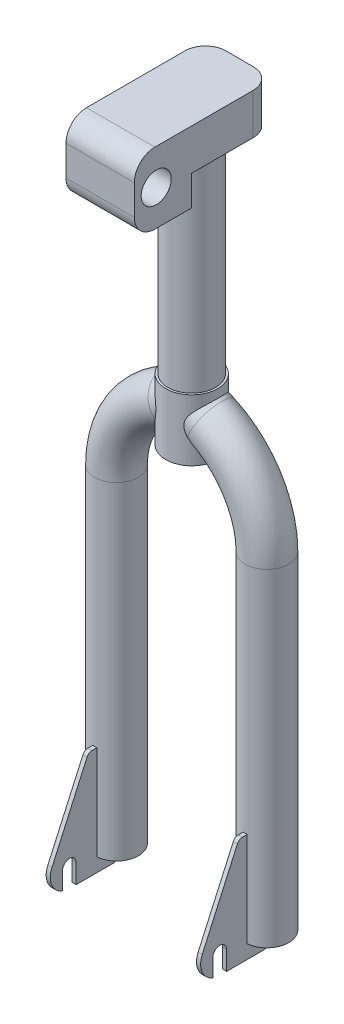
from build123d import *
from build123d.topology import SkipClean

# Parameters (mm, degrees)
ESQUISSE1_R             = 17.5
ESQUISSE1_R_2           = 11
BOSS_EXTRU_1_DEPTH      = 152
BOSS_EXTRU_2_START      = 45
ESQUISSE2_R             = 19
ESQUISSE2_R_2           = 11
BOSS_EXTRU_2_DEPTH      = 45
ESQUISSE4_R             = 16
ESQUISSE5_R             = 11
ENL_V_MAT_EXTRU_1_DEPTH = 290.485750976
BOSS_EXTRU_3_DEPTH      = 1.5
CONG_1_R                = 4
CONG_1_OF_SYM_TRIE1_R   = 4
ESQUISSE7_W             = 50
ESQUISSE7_H             = 102
BOSS_EXTRU_4_DEPTH      = 30
ESQUISSE8_W             = 42
ESQUISSE8_H             = 52
BOSS_EXTRU_5_DEPTH      = 50
CONG_2_R                = 15
ESQUISSE9_R             = 11
ENL_V_MAT_EXTRU_2_DEPTH = 355.866171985


with BuildPart() as part:
    # Esquisse1 → Boss.-Extru.1 (new body)
    with BuildSketch(Plane(origin=(0, 0, 0), x_dir=(1, 0, 0), z_dir=(0, 1, 0))):
        with Locations(Location((0, 0, 0), (0, 0, 270))):
            Circle(ESQUISSE1_R)
        with Locations(Location((0, 0, 0), (0, 0, 270))):
            Circle(ESQUISSE1_R_2, mode=Mode.SUBTRACT)
    extrude(amount=BOSS_EXTRU_1_DEPTH)

    # Esquisse2 → Boss.-Extru.2 (add)
    with SkipClean():  # the faces are left unmerged after this step: merging them gives an invalid solid
        with BuildSketch(Plane.XZ.offset(BOSS_EXTRU_2_START)):
            with Locations(Location((0, 0, 0), (0, 0, 90))):
                Circle(ESQUISSE2_R)
            with Locations(Location((0, 0, 0), (0, 0, 270))):
                Circle(ESQUISSE2_R_2, mode=Mode.SUBTRACT)
        extrude(amount=-BOSS_EXTRU_2_DEPTH)

    # Balayage1: sweep along a path in Esquisse3
    with SkipClean():  # the faces are left unmerged after this step: merging them gives an invalid solid
        with BuildLine(Plane.XY) as balayage1_path:
            Line((0, -15), (14.583278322, -21.800294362))
            ThreePointArc((14.583278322, -21.800294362), (44.037401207, -47.630866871), (55, -85.241839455))
            Line((55, -85.241839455), (55, -325))
        # Esquisse4 → Balayage1 (sweep)
        with BuildSketch(Plane(origin=(0, -325, 0), x_dir=(1, 0, 0), z_dir=(0, 1, 0))):
            with Locations((55, 0)):
                Circle(ESQUISSE4_R)
        balayage1 = sweep(path=balayage1_path.line)

    # Esquisse5 → Enl_v. mat.-Extru.1 (cut, through all)
    with SkipClean():  # the faces are left unmerged after this step: merging them gives an invalid solid
        with BuildSketch(Plane.XZ.offset(45)):
            with Locations(Location((0, 0, 0), (0, 0, 270))):
                Circle(ESQUISSE5_R)
        enl_v_mat_extru_1 = extrude(amount=-ENL_V_MAT_EXTRU_1_DEPTH, mode=Mode.SUBTRACT)

    # Esquisse6 → Boss.-Extru.3 (add, symmetric)
    with SkipClean():  # the faces are left unmerged after this step: merging them gives an invalid solid
        with BuildSketch(Plane(origin=(55, 0, 0), x_dir=(0, 0, -1), z_dir=(1, 0, 0))):
            with BuildLine():
                Line((0, -255.736182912), (-22, -255.736182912))
                Line((-22, -255.736182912), (-48.768226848, -315.257841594))
                ThreePointArc((-48.768226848, -315.257841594), (-48.940819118, -326.341834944), (-41, -334.076696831))
                Line((-41, -334.076696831), (-41, -321))
                ThreePointArc((-41, -321), (-36, -316), (-31, -321))
                Line((-31, -321), (-31, -335))
                Line((-31, -335), (0, -335))
                Line((0, -335), (0, -255.736182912))
            make_face()
        boss_extru_3 = extrude(amount=BOSS_EXTRU_3_DEPTH, both=True)

    # Cong_1
    cong_1_edges = [part.edges().sort_by_distance(p)[0] for p in [
        (55, -335, 0),
        (55, -255.736182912, 22),
    ]]
    fillet(cong_1_edges, radius=CONG_1_R)

    # Sym_trie1: Balayage1, Enl_v. mat.-Extru.1, Boss.-Extru.3 across plane
    add(balayage1.mirror(Plane(origin=(0, 0, 0), x_dir=(0, 0, 1), z_dir=(1, 0, 0))))
    add(enl_v_mat_extru_1.mirror(Plane(origin=(0, 0, 0), x_dir=(0, 0, 1), z_dir=(1, 0, 0))), mode=Mode.SUBTRACT)
    add(boss_extru_3.mirror(Plane(origin=(0, 0, 0), x_dir=(0, 0, 1), z_dir=(1, 0, 0))))

    # Cong_1 of Sym_trie1
    cong_1_of_sym_trie1_edges = [part.edges().sort_by_distance(p)[0] for p in [
        (-55, -335, 0),
        (-55, -255.736182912, 22),
    ]]
    fillet(cong_1_of_sym_trie1_edges, radius=CONG_1_OF_SYM_TRIE1_R)

    # Esquisse7 → Boss.-Extru.4 (add)
    with BuildSketch(Plane(origin=(0, 152, 0), x_dir=(1, 0, 0), z_dir=(0, 1, 0))):
        with Locations((0, -16)):
            Rectangle(ESQUISSE7_W, ESQUISSE7_H)
    extrude(amount=BOSS_EXTRU_4_DEPTH)

    # Esquisse8 → Boss.-Extru.5 (add)
    with BuildSketch(Plane.ZY.offset(25)):
        with Locations((46, 156)):
            Rectangle(ESQUISSE8_W, ESQUISSE8_H)
    extrude(amount=-BOSS_EXTRU_5_DEPTH)

    # Cong_2
    cong_2_edges = [part.edges().sort_by_distance(p)[0] for p in [
        (25, 167, -35),
        (-25, 167, -35),
        (0, 182, 67),
        (0, 130, 67),
    ]]
    fillet(cong_2_edges, radius=CONG_2_R)

    # Esquisse9 → Enl_v. mat.-Extru.2 (cut, through all)
    with BuildSketch(Plane(origin=(25, 0, 0), x_dir=(0, 0, -1), z_dir=(1, 0, 0))):
        with Locations((-51, 156)):
            Circle(ESQUISSE9_R)
    extrude(amount=-ENL_V_MAT_EXTRU_2_DEPTH, mode=Mode.SUBTRACT)


solid = part.part
